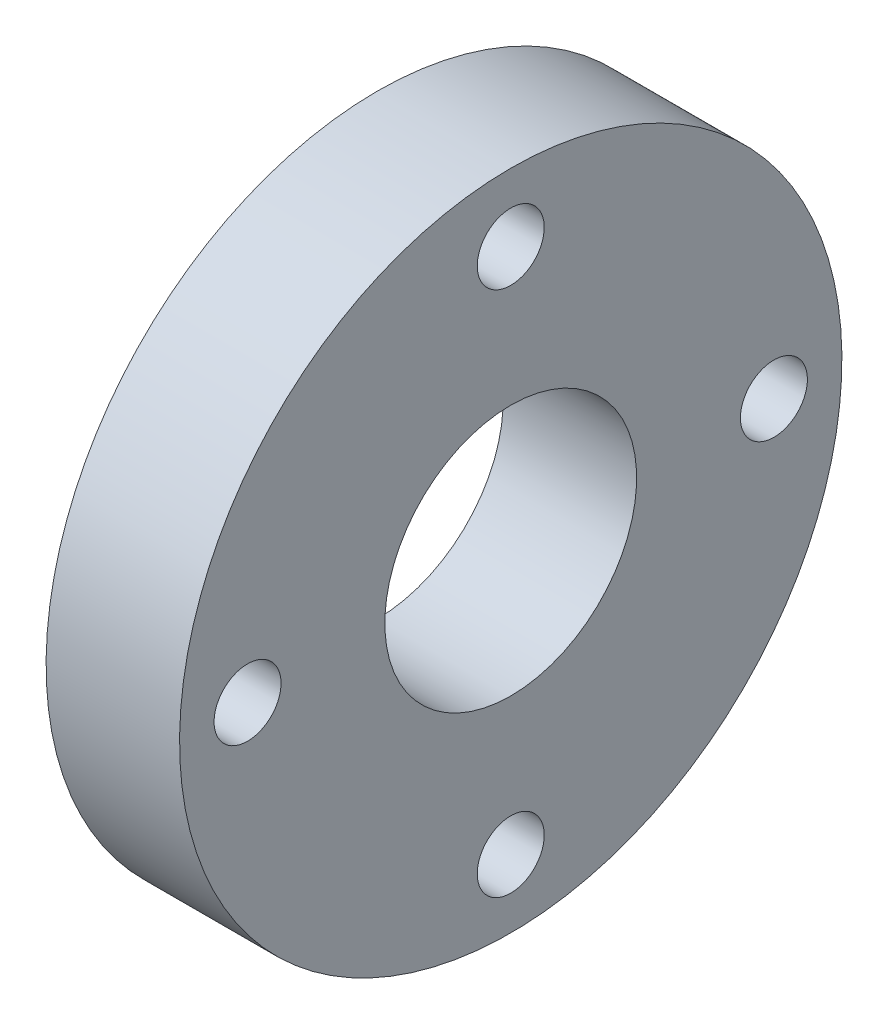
ISO-10303-21;
HEADER;
FILE_DESCRIPTION(('STEP AP214'),'2;1');
FILE_NAME('part.step','',(''),(''),'','','');
FILE_SCHEMA(('AUTOMOTIVE_DESIGN { 1 0 10303 214 1 1 1 1 }'));
ENDSEC;
DATA;
#1=APPLICATION_CONTEXT('core data for automotive mechanical design processes');
#2=APPLICATION_PROTOCOL_DEFINITION('international standard','automotive_design',2000,#1);
#3=PRODUCT_CONTEXT('',#1,'mechanical');
#4=PRODUCT('Part','Part','',(#3));
#5=PRODUCT_RELATED_PRODUCT_CATEGORY('part','',(#4));
#6=PRODUCT_DEFINITION_FORMATION('','',#4);
#7=PRODUCT_DEFINITION_CONTEXT('part definition',#1,'design');
#8=PRODUCT_DEFINITION('design','',#6,#7);
#9=PRODUCT_DEFINITION_SHAPE('','',#8);
#10=(LENGTH_UNIT() NAMED_UNIT(*) SI_UNIT(.MILLI.,.METRE.));
#11=(NAMED_UNIT(*) PLANE_ANGLE_UNIT() SI_UNIT($,.RADIAN.));
#12=(NAMED_UNIT(*) SI_UNIT($,.STERADIAN.) SOLID_ANGLE_UNIT());
#13=UNCERTAINTY_MEASURE_WITH_UNIT(LENGTH_MEASURE(1.E-05),#10,'distance_accuracy_value','');
#14=(GEOMETRIC_REPRESENTATION_CONTEXT(3) GLOBAL_UNCERTAINTY_ASSIGNED_CONTEXT((#13)) GLOBAL_UNIT_ASSIGNED_CONTEXT((#10,
#11,#12)) REPRESENTATION_CONTEXT('',''));
#15=CARTESIAN_POINT('',(0.,0.,0.));
#16=DIRECTION('',(0.,0.,1.));
#17=DIRECTION('',(1.,0.,0.));
#18=AXIS2_PLACEMENT_3D('',#15,#16,#17);
#19=CARTESIAN_POINT('',(-13.462,0.,-33.4009999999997));
#20=DIRECTION('',(1.,0.,0.));
#21=DIRECTION('',(0.,1.,0.));
#22=AXIS2_PLACEMENT_3D('',#19,#20,#21);
#23=PLANE('',#22);
#24=CARTESIAN_POINT('',(-13.462,26.5430000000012,-2.73236009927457E-13));
#25=DIRECTION('',(-1.,0.,0.));
#26=DIRECTION('',(0.,-1.,0.));
#27=AXIS2_PLACEMENT_3D('',#24,#25,#26);
#28=CIRCLE('',#27,3.37820000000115);
#29=CARTESIAN_POINT('',(-13.462,23.1648000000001,-2.37851222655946E-13));
#30=VERTEX_POINT('',#29);
#31=EDGE_CURVE('E69',#30,#30,#28,.T.);
#32=ORIENTED_EDGE('',*,*,#31,.F.);
#33=EDGE_LOOP('',(#32));
#34=FACE_BOUND('',#33,.T.);
#35=CARTESIAN_POINT('',(-13.4620000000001,2.15211943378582E-13,26.5430000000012));
#36=DIRECTION('',(-1.,0.,0.));
#37=DIRECTION('',(0.,0.,-1.));
#38=AXIS2_PLACEMENT_3D('',#35,#36,#37);
#39=CIRCLE('',#38,3.37820000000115);
#40=CARTESIAN_POINT('',(-13.4620000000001,1.91622085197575E-13,23.1648));
#41=VERTEX_POINT('',#40);
#42=EDGE_CURVE('E63',#41,#41,#39,.T.);
#43=ORIENTED_EDGE('',*,*,#42,.F.);
#44=EDGE_LOOP('',(#43));
#45=FACE_BOUND('',#44,.T.);
#46=CARTESIAN_POINT('',(-13.4620000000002,-26.5430000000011,0.));
#47=DIRECTION('',(-1.,0.,0.));
#48=DIRECTION('',(0.,1.,0.));
#49=AXIS2_PLACEMENT_3D('',#46,#47,#48);
#50=CIRCLE('',#49,3.37820000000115);
#51=CARTESIAN_POINT('',(-13.4620000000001,-23.1648,0.));
#52=VERTEX_POINT('',#51);
#53=EDGE_CURVE('E57',#52,#52,#50,.T.);
#54=ORIENTED_EDGE('',*,*,#53,.F.);
#55=EDGE_LOOP('',(#54));
#56=FACE_BOUND('',#55,.T.);
#57=CARTESIAN_POINT('',(-13.4620000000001,0.,-26.5430000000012));
#58=DIRECTION('',(-1.,0.,0.));
#59=DIRECTION('',(0.,0.,1.));
#60=AXIS2_PLACEMENT_3D('',#57,#58,#59);
#61=CIRCLE('',#60,3.37820000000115);
#62=CARTESIAN_POINT('',(-13.4620000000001,0.,-23.1648));
#63=VERTEX_POINT('',#62);
#64=EDGE_CURVE('E51',#63,#63,#61,.T.);
#65=ORIENTED_EDGE('',*,*,#64,.F.);
#66=EDGE_LOOP('',(#65));
#67=FACE_BOUND('',#66,.T.);
#68=CARTESIAN_POINT('',(-13.462,0.,0.));
#69=DIRECTION('',(1.,0.,0.));
#70=DIRECTION('',(0.,1.,0.));
#71=AXIS2_PLACEMENT_3D('',#68,#69,#70);
#72=CIRCLE('',#71,33.4009999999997);
#73=CARTESIAN_POINT('',(-13.4619999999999,33.4009999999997,0.));
#74=VERTEX_POINT('',#73);
#75=EDGE_CURVE('E10',#74,#74,#72,.T.);
#76=ORIENTED_EDGE('',*,*,#75,.F.);
#77=EDGE_LOOP('',(#76));
#78=FACE_BOUND('',#77,.T.);
#79=CARTESIAN_POINT('',(-13.462,0.,0.));
#80=DIRECTION('',(1.,0.,0.));
#81=DIRECTION('',(0.,1.,0.));
#82=AXIS2_PLACEMENT_3D('',#79,#80,#81);
#83=CIRCLE('',#82,12.6999999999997);
#84=CARTESIAN_POINT('',(-13.462,12.6999999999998,0.));
#85=VERTEX_POINT('',#84);
#86=EDGE_CURVE('E43',#85,#85,#83,.T.);
#87=ORIENTED_EDGE('',*,*,#86,.T.);
#88=EDGE_LOOP('',(#87));
#89=FACE_BOUND('',#88,.T.);
#90=ADVANCED_FACE('F29',(#34,#45,#56,#67,#78,#89),#23,.F.);
#91=CARTESIAN_POINT('',(0.,0.,0.));
#92=DIRECTION('',(1.,0.,0.));
#93=DIRECTION('',(0.,1.,0.));
#94=AXIS2_PLACEMENT_3D('',#91,#92,#93);
#95=CYLINDRICAL_SURFACE('',#94,33.4009999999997);
#96=CARTESIAN_POINT('',(0.,0.,0.));
#97=DIRECTION('',(1.,0.,0.));
#98=DIRECTION('',(0.,1.,0.));
#99=AXIS2_PLACEMENT_3D('',#96,#97,#98);
#100=CIRCLE('',#99,33.4009999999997);
#101=CARTESIAN_POINT('',(0.,33.4009999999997,0.));
#102=VERTEX_POINT('',#101);
#103=EDGE_CURVE('E35',#102,#102,#100,.T.);
#104=ORIENTED_EDGE('',*,*,#103,.F.);
#105=EDGE_LOOP('',(#104));
#106=FACE_BOUND('',#105,.T.);
#107=ORIENTED_EDGE('',*,*,#75,.T.);
#108=EDGE_LOOP('',(#107));
#109=FACE_BOUND('',#108,.T.);
#110=ADVANCED_FACE('F78',(#106,#109),#95,.T.);
#111=CARTESIAN_POINT('',(0.,0.,-33.4009999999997));
#112=DIRECTION('',(-1.,0.,0.));
#113=DIRECTION('',(0.,-1.,0.));
#114=AXIS2_PLACEMENT_3D('',#111,#112,#113);
#115=PLANE('',#114);
#116=CARTESIAN_POINT('',(0.,26.5430000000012,-2.71587461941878E-13));
#117=DIRECTION('',(-1.,0.,0.));
#118=DIRECTION('',(0.,-1.,0.));
#119=AXIS2_PLACEMENT_3D('',#116,#117,#118);
#120=CIRCLE('',#119,3.37820000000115);
#121=CARTESIAN_POINT('',(0.,23.1648000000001,-2.71587461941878E-13));
#122=VERTEX_POINT('',#121);
#123=EDGE_CURVE('E66',#122,#122,#120,.F.);
#124=ORIENTED_EDGE('',*,*,#123,.F.);
#125=EDGE_LOOP('',(#124));
#126=FACE_BOUND('',#125,.T.);
#127=CARTESIAN_POINT('',(0.,1.78913019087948E-13,26.5430000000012));
#128=DIRECTION('',(-1.,0.,0.));
#129=DIRECTION('',(0.,-1.,0.));
#130=AXIS2_PLACEMENT_3D('',#127,#128,#129);
#131=CIRCLE('',#130,3.37820000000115);
#132=CARTESIAN_POINT('',(0.,-3.37820000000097,26.5430000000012));
#133=VERTEX_POINT('',#132);
#134=EDGE_CURVE('E60',#133,#133,#131,.F.);
#135=ORIENTED_EDGE('',*,*,#134,.F.);
#136=EDGE_LOOP('',(#135));
#137=FACE_BOUND('',#136,.T.);
#138=CARTESIAN_POINT('',(0.,-26.5430000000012,0.));
#139=DIRECTION('',(-1.,0.,0.));
#140=DIRECTION('',(0.,-1.,0.));
#141=AXIS2_PLACEMENT_3D('',#138,#139,#140);
#142=CIRCLE('',#141,3.37820000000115);
#143=CARTESIAN_POINT('',(0.,-29.9212000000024,0.));
#144=VERTEX_POINT('',#143);
#145=EDGE_CURVE('E54',#144,#144,#142,.F.);
#146=ORIENTED_EDGE('',*,*,#145,.F.);
#147=EDGE_LOOP('',(#146));
#148=FACE_BOUND('',#147,.T.);
#149=CARTESIAN_POINT('',(0.,0.,-26.5430000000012));
#150=DIRECTION('',(-1.,0.,0.));
#151=DIRECTION('',(0.,-1.,0.));
#152=AXIS2_PLACEMENT_3D('',#149,#150,#151);
#153=CIRCLE('',#152,3.37820000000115);
#154=CARTESIAN_POINT('',(0.,-3.37820000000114,-26.5430000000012));
#155=VERTEX_POINT('',#154);
#156=EDGE_CURVE('E48',#155,#155,#153,.F.);
#157=ORIENTED_EDGE('',*,*,#156,.F.);
#158=EDGE_LOOP('',(#157));
#159=FACE_BOUND('',#158,.T.);
#160=CARTESIAN_POINT('',(0.,0.,0.));
#161=DIRECTION('',(1.,0.,0.));
#162=DIRECTION('',(0.,1.,0.));
#163=AXIS2_PLACEMENT_3D('',#160,#161,#162);
#164=CIRCLE('',#163,12.6999999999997);
#165=CARTESIAN_POINT('',(0.,12.6999999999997,0.));
#166=VERTEX_POINT('',#165);
#167=EDGE_CURVE('E39',#166,#166,#164,.T.);
#168=ORIENTED_EDGE('',*,*,#167,.F.);
#169=EDGE_LOOP('',(#168));
#170=FACE_BOUND('',#169,.T.);
#171=ORIENTED_EDGE('',*,*,#103,.T.);
#172=EDGE_LOOP('',(#171));
#173=FACE_BOUND('',#172,.T.);
#174=ADVANCED_FACE('F92',(#126,#137,#148,#159,#170,#173),#115,.F.);
#175=CARTESIAN_POINT('',(0.,0.,0.));
#176=DIRECTION('',(1.,0.,0.));
#177=DIRECTION('',(0.,1.,0.));
#178=AXIS2_PLACEMENT_3D('',#175,#176,#177);
#179=CYLINDRICAL_SURFACE('',#178,12.6999999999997);
#180=ORIENTED_EDGE('',*,*,#86,.F.);
#181=EDGE_LOOP('',(#180));
#182=FACE_BOUND('',#181,.T.);
#183=ORIENTED_EDGE('',*,*,#167,.T.);
#184=EDGE_LOOP('',(#183));
#185=FACE_BOUND('',#184,.T.);
#186=ADVANCED_FACE('F88',(#182,#185),#179,.F.);
#187=CARTESIAN_POINT('',(0.00100000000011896,0.,-26.5430000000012));
#188=DIRECTION('',(-1.,0.,0.));
#189=DIRECTION('',(0.,0.,1.));
#190=AXIS2_PLACEMENT_3D('',#187,#188,#189);
#191=CYLINDRICAL_SURFACE('',#190,3.37820000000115);
#192=ORIENTED_EDGE('',*,*,#64,.T.);
#193=EDGE_LOOP('',(#192));
#194=FACE_BOUND('',#193,.T.);
#195=ORIENTED_EDGE('',*,*,#156,.T.);
#196=EDGE_LOOP('',(#195));
#197=FACE_BOUND('',#196,.T.);
#198=ADVANCED_FACE('F91',(#194,#197),#191,.F.);
#199=CARTESIAN_POINT('',(0.00100000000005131,-26.5430000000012,0.));
#200=DIRECTION('',(-1.,0.,0.));
#201=DIRECTION('',(0.,-1.,0.));
#202=AXIS2_PLACEMENT_3D('',#199,#200,#201);
#203=CYLINDRICAL_SURFACE('',#202,3.37820000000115);
#204=ORIENTED_EDGE('',*,*,#53,.T.);
#205=EDGE_LOOP('',(#204));
#206=FACE_BOUND('',#205,.T.);
#207=ORIENTED_EDGE('',*,*,#145,.T.);
#208=EDGE_LOOP('',(#207));
#209=FACE_BOUND('',#208,.T.);
#210=ADVANCED_FACE('F108',(#206,#209),#203,.F.);
#211=CARTESIAN_POINT('',(0.0010000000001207,1.78910322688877E-13,26.5430000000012));
#212=DIRECTION('',(-1.,0.,0.));
#213=DIRECTION('',(0.,0.,1.));
#214=AXIS2_PLACEMENT_3D('',#211,#212,#213);
#215=CYLINDRICAL_SURFACE('',#214,3.37820000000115);
#216=ORIENTED_EDGE('',*,*,#42,.T.);
#217=EDGE_LOOP('',(#216));
#218=FACE_BOUND('',#217,.T.);
#219=ORIENTED_EDGE('',*,*,#134,.T.);
#220=EDGE_LOOP('',(#219));
#221=FACE_BOUND('',#220,.T.);
#222=ADVANCED_FACE('F112',(#218,#221),#215,.F.);
#223=CARTESIAN_POINT('',(0.00100000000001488,26.5430000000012,-2.71587339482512E-13));
#224=DIRECTION('',(-1.,0.,0.));
#225=DIRECTION('',(0.,-1.,0.));
#226=AXIS2_PLACEMENT_3D('',#223,#224,#225);
#227=CYLINDRICAL_SURFACE('',#226,3.37820000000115);
#228=ORIENTED_EDGE('',*,*,#31,.T.);
#229=EDGE_LOOP('',(#228));
#230=FACE_BOUND('',#229,.T.);
#231=ORIENTED_EDGE('',*,*,#123,.T.);
#232=EDGE_LOOP('',(#231));
#233=FACE_BOUND('',#232,.T.);
#234=ADVANCED_FACE('F73',(#230,#233),#227,.F.);
#235=CLOSED_SHELL('',(#90,#110,#174,#186,#198,#210,#222,#234));
#236=MANIFOLD_SOLID_BREP('B2',#235);
#237=ADVANCED_BREP_SHAPE_REPRESENTATION('',(#18,#236),#14);
#238=SHAPE_DEFINITION_REPRESENTATION(#9,#237);
ENDSEC;
END-ISO-10303-21;
